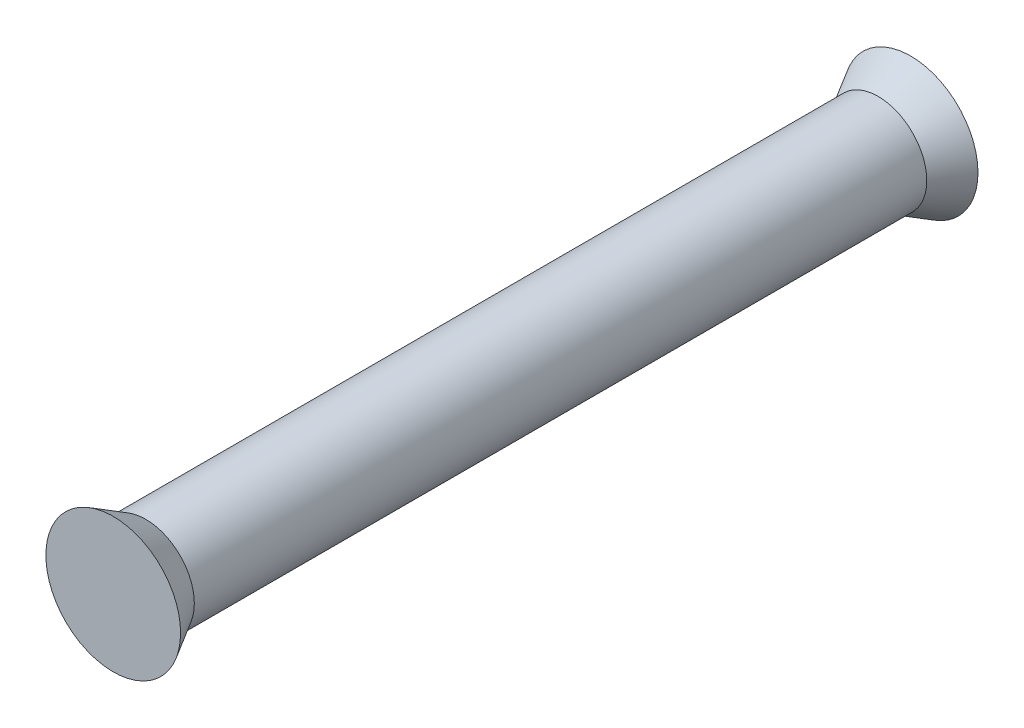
ISO-10303-21;
HEADER;
FILE_DESCRIPTION(('STEP AP214'),'2;1');
FILE_NAME('part.step','',(''),(''),'','','');
FILE_SCHEMA(('AUTOMOTIVE_DESIGN { 1 0 10303 214 1 1 1 1 }'));
ENDSEC;
DATA;
#1=APPLICATION_CONTEXT('core data for automotive mechanical design processes');
#2=APPLICATION_PROTOCOL_DEFINITION('international standard','automotive_design',2000,#1);
#3=PRODUCT_CONTEXT('',#1,'mechanical');
#4=PRODUCT('Part','Part','',(#3));
#5=PRODUCT_RELATED_PRODUCT_CATEGORY('part','',(#4));
#6=PRODUCT_DEFINITION_FORMATION('','',#4);
#7=PRODUCT_DEFINITION_CONTEXT('part definition',#1,'design');
#8=PRODUCT_DEFINITION('design','',#6,#7);
#9=PRODUCT_DEFINITION_SHAPE('','',#8);
#10=(LENGTH_UNIT() NAMED_UNIT(*) SI_UNIT(.MILLI.,.METRE.));
#11=(NAMED_UNIT(*) PLANE_ANGLE_UNIT() SI_UNIT($,.RADIAN.));
#12=(NAMED_UNIT(*) SI_UNIT($,.STERADIAN.) SOLID_ANGLE_UNIT());
#13=UNCERTAINTY_MEASURE_WITH_UNIT(LENGTH_MEASURE(1.E-05),#10,'distance_accuracy_value','');
#14=(GEOMETRIC_REPRESENTATION_CONTEXT(3) GLOBAL_UNCERTAINTY_ASSIGNED_CONTEXT((#13)) GLOBAL_UNIT_ASSIGNED_CONTEXT((#10,
#11,#12)) REPRESENTATION_CONTEXT('',''));
#15=CARTESIAN_POINT('',(0.,0.,0.));
#16=DIRECTION('',(0.,0.,1.));
#17=DIRECTION('',(1.,0.,0.));
#18=AXIS2_PLACEMENT_3D('',#15,#16,#17);
#19=CARTESIAN_POINT('',(0.,3.29144355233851,0.));
#20=DIRECTION('',(0.,0.,-1.));
#21=DIRECTION('',(-1.,0.,0.));
#22=AXIS2_PLACEMENT_3D('',#19,#20,#21);
#23=PLANE('',#22);
#24=CARTESIAN_POINT('',(0.,0.,0.));
#25=DIRECTION('',(0.,0.,1.));
#26=DIRECTION('',(1.,0.,0.));
#27=AXIS2_PLACEMENT_3D('',#24,#25,#26);
#28=CIRCLE('',#27,3.29144355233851);
#29=CARTESIAN_POINT('',(3.29144355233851,0.,0.));
#30=VERTEX_POINT('',#29);
#31=EDGE_CURVE('E47',#30,#30,#28,.T.);
#32=ORIENTED_EDGE('',*,*,#31,.T.);
#33=EDGE_LOOP('',(#32));
#34=FACE_BOUND('',#33,.T.);
#35=ADVANCED_FACE('F33',(#34),#23,.F.);
#36=CARTESIAN_POINT('',(0.,0.,-38.9636));
#37=DIRECTION('',(0.,0.,1.));
#38=DIRECTION('',(1.,0.,0.));
#39=AXIS2_PLACEMENT_3D('',#36,#37,#38);
#40=PLANE('',#39);
#41=CARTESIAN_POINT('',(0.,0.,-38.9636));
#42=DIRECTION('',(0.,0.,1.));
#43=DIRECTION('',(1.,0.,0.));
#44=AXIS2_PLACEMENT_3D('',#41,#42,#43);
#45=CIRCLE('',#44,3.29144355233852);
#46=CARTESIAN_POINT('',(3.29144355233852,0.,-38.9636));
#47=VERTEX_POINT('',#46);
#48=EDGE_CURVE('E10',#47,#47,#45,.T.);
#49=ORIENTED_EDGE('',*,*,#48,.F.);
#50=EDGE_LOOP('',(#49));
#51=FACE_BOUND('',#50,.T.);
#52=ADVANCED_FACE('F67',(#51),#40,.F.);
#53=CARTESIAN_POINT('',(0.,0.,-38.9636));
#54=DIRECTION('',(0.,0.,-1.));
#55=DIRECTION('',(-1.,0.,0.));
#56=AXIS2_PLACEMENT_3D('',#53,#54,#55);
#57=CONICAL_SURFACE('',#56,3.29144355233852,0.523598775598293);
#58=CARTESIAN_POINT('',(0.,0.,-37.3761));
#59=DIRECTION('',(0.,0.,1.));
#60=DIRECTION('',(1.,0.,0.));
#61=AXIS2_PLACEMENT_3D('',#58,#59,#60);
#62=CIRCLE('',#61,2.3749);
#63=CARTESIAN_POINT('',(2.3749,0.,-37.3761));
#64=VERTEX_POINT('',#63);
#65=EDGE_CURVE('E39',#64,#64,#62,.T.);
#66=ORIENTED_EDGE('',*,*,#65,.F.);
#67=EDGE_LOOP('',(#66));
#68=FACE_BOUND('',#67,.T.);
#69=ORIENTED_EDGE('',*,*,#48,.T.);
#70=EDGE_LOOP('',(#69));
#71=FACE_BOUND('',#70,.T.);
#72=ADVANCED_FACE('F62',(#68,#71),#57,.T.);
#73=CARTESIAN_POINT('',(0.,0.,0.));
#74=DIRECTION('',(0.,0.,1.));
#75=DIRECTION('',(1.,0.,0.));
#76=AXIS2_PLACEMENT_3D('',#73,#74,#75);
#77=CYLINDRICAL_SURFACE('',#76,2.3749);
#78=CARTESIAN_POINT('',(0.,0.,-1.5875));
#79=DIRECTION('',(0.,0.,1.));
#80=DIRECTION('',(1.,0.,0.));
#81=AXIS2_PLACEMENT_3D('',#78,#79,#80);
#82=CIRCLE('',#81,2.3749);
#83=CARTESIAN_POINT('',(2.3749,0.,-1.5875));
#84=VERTEX_POINT('',#83);
#85=EDGE_CURVE('E43',#84,#84,#82,.T.);
#86=ORIENTED_EDGE('',*,*,#85,.F.);
#87=EDGE_LOOP('',(#86));
#88=FACE_BOUND('',#87,.T.);
#89=ORIENTED_EDGE('',*,*,#65,.T.);
#90=EDGE_LOOP('',(#89));
#91=FACE_BOUND('',#90,.T.);
#92=ADVANCED_FACE('F57',(#88,#91),#77,.T.);
#93=CARTESIAN_POINT('',(0.,0.,-1.5875));
#94=DIRECTION('',(0.,0.,1.));
#95=DIRECTION('',(1.,0.,0.));
#96=AXIS2_PLACEMENT_3D('',#93,#94,#95);
#97=CONICAL_SURFACE('',#96,2.3749,0.523598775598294);
#98=ORIENTED_EDGE('',*,*,#31,.F.);
#99=EDGE_LOOP('',(#98));
#100=FACE_BOUND('',#99,.T.);
#101=ORIENTED_EDGE('',*,*,#85,.T.);
#102=EDGE_LOOP('',(#101));
#103=FACE_BOUND('',#102,.T.);
#104=ADVANCED_FACE('F54',(#100,#103),#97,.T.);
#105=CLOSED_SHELL('',(#35,#52,#72,#92,#104));
#106=MANIFOLD_SOLID_BREP('B2',#105);
#107=ADVANCED_BREP_SHAPE_REPRESENTATION('',(#18,#106),#14);
#108=SHAPE_DEFINITION_REPRESENTATION(#9,#107);
ENDSEC;
END-ISO-10303-21;
